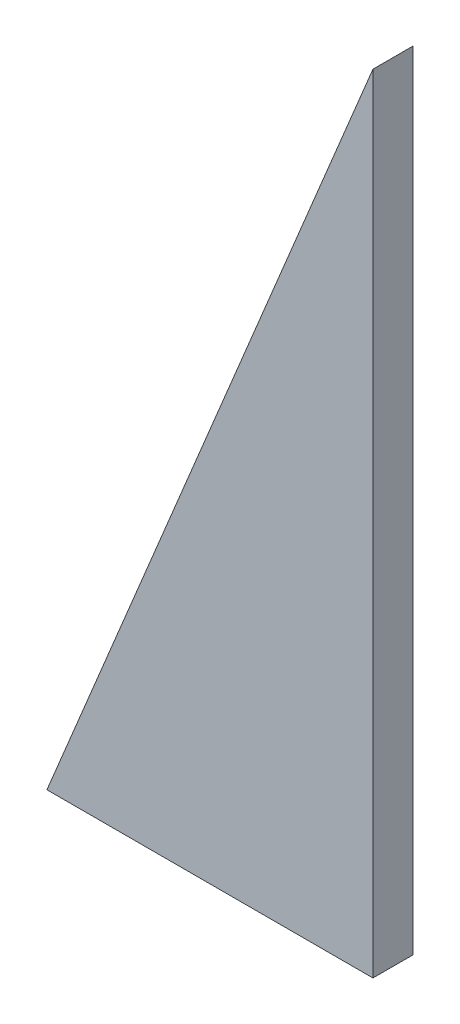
ISO-10303-21;
HEADER;
FILE_DESCRIPTION(('STEP AP214'),'2;1');
FILE_NAME('part.step','',(''),(''),'','','');
FILE_SCHEMA(('AUTOMOTIVE_DESIGN { 1 0 10303 214 1 1 1 1 }'));
ENDSEC;
DATA;
#1=APPLICATION_CONTEXT('core data for automotive mechanical design processes');
#2=APPLICATION_PROTOCOL_DEFINITION('international standard','automotive_design',2000,#1);
#3=PRODUCT_CONTEXT('',#1,'mechanical');
#4=PRODUCT('Part','Part','',(#3));
#5=PRODUCT_RELATED_PRODUCT_CATEGORY('part','',(#4));
#6=PRODUCT_DEFINITION_FORMATION('','',#4);
#7=PRODUCT_DEFINITION_CONTEXT('part definition',#1,'design');
#8=PRODUCT_DEFINITION('design','',#6,#7);
#9=PRODUCT_DEFINITION_SHAPE('','',#8);
#10=(LENGTH_UNIT() NAMED_UNIT(*) SI_UNIT(.MILLI.,.METRE.));
#11=(NAMED_UNIT(*) PLANE_ANGLE_UNIT() SI_UNIT($,.RADIAN.));
#12=(NAMED_UNIT(*) SI_UNIT($,.STERADIAN.) SOLID_ANGLE_UNIT());
#13=UNCERTAINTY_MEASURE_WITH_UNIT(LENGTH_MEASURE(1.E-05),#10,'distance_accuracy_value','');
#14=(GEOMETRIC_REPRESENTATION_CONTEXT(3) GLOBAL_UNCERTAINTY_ASSIGNED_CONTEXT((#13)) GLOBAL_UNIT_ASSIGNED_CONTEXT((#10,
#11,#12)) REPRESENTATION_CONTEXT('',''));
#15=CARTESIAN_POINT('',(0.,0.,0.));
#16=DIRECTION('',(0.,0.,1.));
#17=DIRECTION('',(1.,0.,0.));
#18=AXIS2_PLACEMENT_3D('',#15,#16,#17);
#19=CARTESIAN_POINT('',(65.,156.923881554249,8.));
#20=DIRECTION('',(0.923879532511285,-0.382683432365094,0.));
#21=DIRECTION('',(0.382683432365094,0.923879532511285,0.));
#22=AXIS2_PLACEMENT_3D('',#19,#20,#21);
#23=PLANE('',#22);
#24=CARTESIAN_POINT('',(13.3939201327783,32.335783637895,4.));
#25=DIRECTION('',(-0.923879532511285,0.382683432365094,0.));
#26=DIRECTION('',(-0.382683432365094,-0.923879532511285,0.));
#27=AXIS2_PLACEMENT_3D('',#24,#25,#26);
#28=CIRCLE('',#27,2.1);
#29=CARTESIAN_POINT('',(12.5902849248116,30.3956366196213,4.));
#30=VERTEX_POINT('',#29);
#31=EDGE_CURVE('E111',#30,#30,#28,.T.);
#32=ORIENTED_EDGE('',*,*,#31,.F.);
#33=EDGE_LOOP('',(#32));
#34=FACE_BOUND('',#33,.T.);
#35=CARTESIAN_POINT('',(42.0951775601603,101.626748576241,4.));
#36=DIRECTION('',(-0.923879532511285,0.382683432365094,0.));
#37=DIRECTION('',(-0.382683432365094,-0.923879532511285,0.));
#38=AXIS2_PLACEMENT_3D('',#35,#36,#37);
#39=CIRCLE('',#38,2.1);
#40=CARTESIAN_POINT('',(41.2915423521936,99.6866015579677,4.));
#41=VERTEX_POINT('',#40);
#42=EDGE_CURVE('E117',#41,#41,#39,.T.);
#43=ORIENTED_EDGE('',*,*,#42,.F.);
#44=EDGE_LOOP('',(#43));
#45=FACE_BOUND('',#44,.T.);
#46=DIRECTION('',(-0.382683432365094,-0.923879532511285,0.));
#47=VECTOR('',#46,1.);
#48=CARTESIAN_POINT('',(65.,156.923881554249,0.));
#49=LINE('',#48,#47);
#50=CARTESIAN_POINT('',(65.,156.923881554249,0.));
#51=VERTEX_POINT('',#50);
#52=CARTESIAN_POINT('',(0.,0.,0.));
#53=VERTEX_POINT('',#52);
#54=EDGE_CURVE('E123',#51,#53,#49,.T.);
#55=ORIENTED_EDGE('',*,*,#54,.T.);
#56=DIRECTION('',(0.,0.,-1.));
#57=VECTOR('',#56,1.);
#58=CARTESIAN_POINT('',(0.,0.,8.));
#59=LINE('',#58,#57);
#60=CARTESIAN_POINT('',(0.,0.,8.));
#61=VERTEX_POINT('',#60);
#62=EDGE_CURVE('E11',#61,#53,#59,.T.);
#63=ORIENTED_EDGE('',*,*,#62,.F.);
#64=DIRECTION('',(-0.382683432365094,-0.923879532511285,0.));
#65=VECTOR('',#64,1.);
#66=CARTESIAN_POINT('',(65.,156.923881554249,8.));
#67=LINE('',#66,#65);
#68=CARTESIAN_POINT('',(65.,156.923881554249,8.));
#69=VERTEX_POINT('',#68);
#70=EDGE_CURVE('E124',#69,#61,#67,.T.);
#71=ORIENTED_EDGE('',*,*,#70,.F.);
#72=DIRECTION('',(0.,0.,-1.));
#73=VECTOR('',#72,1.);
#74=CARTESIAN_POINT('',(65.,156.923881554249,8.));
#75=LINE('',#74,#73);
#76=EDGE_CURVE('E129',#69,#51,#75,.T.);
#77=ORIENTED_EDGE('',*,*,#76,.T.);
#78=EDGE_LOOP('',(#55,#63,#71,#77));
#79=FACE_BOUND('',#78,.T.);
#80=ADVANCED_FACE('F40',(#34,#45,#79),#23,.F.);
#81=CARTESIAN_POINT('',(0.,0.,8.));
#82=DIRECTION('',(0.,1.,0.));
#83=DIRECTION('',(0.,0.,1.));
#84=AXIS2_PLACEMENT_3D('',#81,#82,#83);
#85=PLANE('',#84);
#86=CARTESIAN_POINT('',(22.5,0.,4.));
#87=DIRECTION('',(0.,-1.,0.));
#88=DIRECTION('',(0.,0.,-1.));
#89=AXIS2_PLACEMENT_3D('',#86,#87,#88);
#90=CIRCLE('',#89,2.09999999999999);
#91=CARTESIAN_POINT('',(22.5,0.,1.90000000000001));
#92=VERTEX_POINT('',#91);
#93=EDGE_CURVE('E101',#92,#92,#90,.T.);
#94=ORIENTED_EDGE('',*,*,#93,.F.);
#95=EDGE_LOOP('',(#94));
#96=FACE_BOUND('',#95,.T.);
#97=CARTESIAN_POINT('',(52.5,0.,4.00000000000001));
#98=DIRECTION('',(0.,-1.,0.));
#99=DIRECTION('',(0.,0.,-1.));
#100=AXIS2_PLACEMENT_3D('',#97,#98,#99);
#101=CIRCLE('',#100,2.09999999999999);
#102=CARTESIAN_POINT('',(52.5,0.,1.90000000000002));
#103=VERTEX_POINT('',#102);
#104=EDGE_CURVE('E100',#103,#103,#101,.T.);
#105=ORIENTED_EDGE('',*,*,#104,.F.);
#106=EDGE_LOOP('',(#105));
#107=FACE_BOUND('',#106,.T.);
#108=DIRECTION('',(1.,0.,0.));
#109=VECTOR('',#108,1.);
#110=CARTESIAN_POINT('',(0.,0.,0.));
#111=LINE('',#110,#109);
#112=CARTESIAN_POINT('',(65.,0.,0.));
#113=VERTEX_POINT('',#112);
#114=EDGE_CURVE('E69',#53,#113,#111,.T.);
#115=ORIENTED_EDGE('',*,*,#114,.T.);
#116=DIRECTION('',(0.,0.,-1.));
#117=VECTOR('',#116,1.);
#118=CARTESIAN_POINT('',(65.,0.,8.));
#119=LINE('',#118,#117);
#120=CARTESIAN_POINT('',(65.,0.,8.));
#121=VERTEX_POINT('',#120);
#122=EDGE_CURVE('E48',#121,#113,#119,.T.);
#123=ORIENTED_EDGE('',*,*,#122,.F.);
#124=DIRECTION('',(1.,0.,0.));
#125=VECTOR('',#124,1.);
#126=CARTESIAN_POINT('',(0.,0.,8.));
#127=LINE('',#126,#125);
#128=EDGE_CURVE('E77',#61,#121,#127,.T.);
#129=ORIENTED_EDGE('',*,*,#128,.F.);
#130=ORIENTED_EDGE('',*,*,#62,.T.);
#131=EDGE_LOOP('',(#115,#123,#129,#130));
#132=FACE_BOUND('',#131,.T.);
#133=ADVANCED_FACE('F150',(#96,#107,#132),#85,.F.);
#134=CARTESIAN_POINT('',(65.,0.,8.));
#135=DIRECTION('',(-1.,0.,0.));
#136=DIRECTION('',(0.,0.,1.));
#137=AXIS2_PLACEMENT_3D('',#134,#135,#136);
#138=PLANE('',#137);
#139=DIRECTION('',(0.,1.,0.));
#140=VECTOR('',#139,1.);
#141=CARTESIAN_POINT('',(65.,0.,0.));
#142=LINE('',#141,#140);
#143=EDGE_CURVE('E74',#113,#51,#142,.T.);
#144=ORIENTED_EDGE('',*,*,#143,.T.);
#145=ORIENTED_EDGE('',*,*,#76,.F.);
#146=DIRECTION('',(0.,1.,0.));
#147=VECTOR('',#146,1.);
#148=CARTESIAN_POINT('',(65.,0.,8.));
#149=LINE('',#148,#147);
#150=EDGE_CURVE('E56',#121,#69,#149,.T.);
#151=ORIENTED_EDGE('',*,*,#150,.F.);
#152=ORIENTED_EDGE('',*,*,#122,.T.);
#153=EDGE_LOOP('',(#144,#145,#151,#152));
#154=FACE_BOUND('',#153,.T.);
#155=ADVANCED_FACE('F134',(#154),#138,.F.);
#156=CARTESIAN_POINT('',(0.,0.,8.));
#157=DIRECTION('',(0.,0.,1.));
#158=DIRECTION('',(1.,0.,0.));
#159=AXIS2_PLACEMENT_3D('',#156,#157,#158);
#160=PLANE('',#159);
#161=ORIENTED_EDGE('',*,*,#70,.T.);
#162=ORIENTED_EDGE('',*,*,#128,.T.);
#163=ORIENTED_EDGE('',*,*,#150,.T.);
#164=EDGE_LOOP('',(#161,#162,#163));
#165=FACE_BOUND('',#164,.T.);
#166=ADVANCED_FACE('F141',(#165),#160,.T.);
#167=CARTESIAN_POINT('',(0.,0.,0.));
#168=DIRECTION('',(0.,0.,1.));
#169=DIRECTION('',(1.,0.,0.));
#170=AXIS2_PLACEMENT_3D('',#167,#168,#169);
#171=PLANE('',#170);
#172=ORIENTED_EDGE('',*,*,#54,.F.);
#173=ORIENTED_EDGE('',*,*,#143,.F.);
#174=ORIENTED_EDGE('',*,*,#114,.F.);
#175=EDGE_LOOP('',(#172,#173,#174));
#176=FACE_BOUND('',#175,.T.);
#177=ADVANCED_FACE('F137',(#176),#171,.F.);
#178=CARTESIAN_POINT('',(55.0294910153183,96.2691805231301,4.));
#179=DIRECTION('',(-0.923879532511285,0.382683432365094,0.));
#180=DIRECTION('',(-0.382683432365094,-0.923879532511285,0.));
#181=AXIS2_PLACEMENT_3D('',#178,#179,#180);
#182=CONICAL_SURFACE('',#181,2.1,1.02974425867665);
#183=CARTESIAN_POINT('',(56.1952489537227,95.7863077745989,4.));
#184=VERTEX_POINT('',#183);
#185=VERTEX_LOOP('',#184);
#186=FACE_BOUND('',#185,.T.);
#187=CARTESIAN_POINT('',(55.0294910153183,96.2691805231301,4.));
#188=DIRECTION('',(-0.923879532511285,0.382683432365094,0.));
#189=DIRECTION('',(-0.382683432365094,-0.923879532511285,0.));
#190=AXIS2_PLACEMENT_3D('',#187,#188,#189);
#191=CIRCLE('',#190,2.1);
#192=CARTESIAN_POINT('',(54.2258558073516,94.3290335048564,4.));
#193=VERTEX_POINT('',#192);
#194=EDGE_CURVE('E120',#193,#193,#191,.T.);
#195=ORIENTED_EDGE('',*,*,#194,.T.);
#196=EDGE_LOOP('',(#195));
#197=FACE_BOUND('',#196,.T.);
#198=ADVANCED_FACE('F148',(#186,#197),#182,.F.);
#199=CARTESIAN_POINT('',(42.0951775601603,101.626748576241,4.));
#200=DIRECTION('',(-0.923879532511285,0.382683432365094,0.));
#201=DIRECTION('',(-0.382683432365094,-0.923879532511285,0.));
#202=AXIS2_PLACEMENT_3D('',#199,#200,#201);
#203=CYLINDRICAL_SURFACE('',#202,2.1);
#204=ORIENTED_EDGE('',*,*,#194,.F.);
#205=EDGE_LOOP('',(#204));
#206=FACE_BOUND('',#205,.T.);
#207=ORIENTED_EDGE('',*,*,#42,.T.);
#208=EDGE_LOOP('',(#207));
#209=FACE_BOUND('',#208,.T.);
#210=ADVANCED_FACE('F163',(#206,#209),#203,.F.);
#211=CARTESIAN_POINT('',(26.3282335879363,26.9782155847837,4.));
#212=DIRECTION('',(-0.923879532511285,0.382683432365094,0.));
#213=DIRECTION('',(-0.382683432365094,-0.923879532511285,0.));
#214=AXIS2_PLACEMENT_3D('',#211,#212,#213);
#215=CONICAL_SURFACE('',#214,2.1,1.02974425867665);
#216=CARTESIAN_POINT('',(27.4939915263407,26.4953428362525,4.));
#217=VERTEX_POINT('',#216);
#218=VERTEX_LOOP('',#217);
#219=FACE_BOUND('',#218,.T.);
#220=CARTESIAN_POINT('',(26.3282335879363,26.9782155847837,4.));
#221=DIRECTION('',(-0.923879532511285,0.382683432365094,0.));
#222=DIRECTION('',(-0.382683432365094,-0.923879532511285,0.));
#223=AXIS2_PLACEMENT_3D('',#220,#221,#222);
#224=CIRCLE('',#223,2.1);
#225=CARTESIAN_POINT('',(25.5245983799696,25.03806856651,4.));
#226=VERTEX_POINT('',#225);
#227=EDGE_CURVE('E114',#226,#226,#224,.T.);
#228=ORIENTED_EDGE('',*,*,#227,.T.);
#229=EDGE_LOOP('',(#228));
#230=FACE_BOUND('',#229,.T.);
#231=ADVANCED_FACE('F165',(#219,#230),#215,.F.);
#232=CARTESIAN_POINT('',(13.3939201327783,32.335783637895,4.));
#233=DIRECTION('',(-0.923879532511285,0.382683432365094,0.));
#234=DIRECTION('',(-0.382683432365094,-0.923879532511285,0.));
#235=AXIS2_PLACEMENT_3D('',#232,#233,#234);
#236=CYLINDRICAL_SURFACE('',#235,2.1);
#237=ORIENTED_EDGE('',*,*,#227,.F.);
#238=EDGE_LOOP('',(#237));
#239=FACE_BOUND('',#238,.T.);
#240=ORIENTED_EDGE('',*,*,#31,.T.);
#241=EDGE_LOOP('',(#240));
#242=FACE_BOUND('',#241,.T.);
#243=ADVANCED_FACE('F172',(#239,#242),#236,.F.);
#244=CARTESIAN_POINT('',(52.5,14.,4.00000000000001));
#245=DIRECTION('',(0.,-1.,0.));
#246=DIRECTION('',(0.,0.,-1.));
#247=AXIS2_PLACEMENT_3D('',#244,#245,#246);
#248=CONICAL_SURFACE('',#247,2.09999999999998,1.02974425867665);
#249=CARTESIAN_POINT('',(52.5,15.2618072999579,4.00000000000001));
#250=VERTEX_POINT('',#249);
#251=VERTEX_LOOP('',#250);
#252=FACE_BOUND('',#251,.T.);
#253=CARTESIAN_POINT('',(52.5,14.,4.00000000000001));
#254=DIRECTION('',(0.,-1.,0.));
#255=DIRECTION('',(0.,0.,-1.));
#256=AXIS2_PLACEMENT_3D('',#253,#254,#255);
#257=CIRCLE('',#256,2.09999999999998);
#258=CARTESIAN_POINT('',(52.5,14.,1.90000000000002));
#259=VERTEX_POINT('',#258);
#260=EDGE_CURVE('E104',#259,#259,#257,.T.);
#261=ORIENTED_EDGE('',*,*,#260,.T.);
#262=EDGE_LOOP('',(#261));
#263=FACE_BOUND('',#262,.T.);
#264=ADVANCED_FACE('F180',(#252,#263),#248,.F.);
#265=CARTESIAN_POINT('',(52.5,0.,4.00000000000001));
#266=DIRECTION('',(0.,-1.,0.));
#267=DIRECTION('',(0.,0.,-1.));
#268=AXIS2_PLACEMENT_3D('',#265,#266,#267);
#269=CYLINDRICAL_SURFACE('',#268,2.09999999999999);
#270=ORIENTED_EDGE('',*,*,#260,.F.);
#271=EDGE_LOOP('',(#270));
#272=FACE_BOUND('',#271,.T.);
#273=ORIENTED_EDGE('',*,*,#104,.T.);
#274=EDGE_LOOP('',(#273));
#275=FACE_BOUND('',#274,.T.);
#276=ADVANCED_FACE('F94',(#272,#275),#269,.F.);
#277=CARTESIAN_POINT('',(22.5,14.,4.));
#278=DIRECTION('',(0.,-1.,0.));
#279=DIRECTION('',(0.,0.,-1.));
#280=AXIS2_PLACEMENT_3D('',#277,#278,#279);
#281=CONICAL_SURFACE('',#280,2.09999999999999,1.02974425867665);
#282=CARTESIAN_POINT('',(22.5,15.2618072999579,4.));
#283=VERTEX_POINT('',#282);
#284=VERTEX_LOOP('',#283);
#285=FACE_BOUND('',#284,.T.);
#286=CARTESIAN_POINT('',(22.5,14.,4.));
#287=DIRECTION('',(0.,-1.,0.));
#288=DIRECTION('',(0.,0.,-1.));
#289=AXIS2_PLACEMENT_3D('',#286,#287,#288);
#290=CIRCLE('',#289,2.09999999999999);
#291=CARTESIAN_POINT('',(22.5,14.,1.90000000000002));
#292=VERTEX_POINT('',#291);
#293=EDGE_CURVE('E98',#292,#292,#290,.T.);
#294=ORIENTED_EDGE('',*,*,#293,.T.);
#295=EDGE_LOOP('',(#294));
#296=FACE_BOUND('',#295,.T.);
#297=ADVANCED_FACE('F90',(#285,#296),#281,.F.);
#298=CARTESIAN_POINT('',(22.5,0.,4.));
#299=DIRECTION('',(0.,-1.,0.));
#300=DIRECTION('',(0.,0.,-1.));
#301=AXIS2_PLACEMENT_3D('',#298,#299,#300);
#302=CYLINDRICAL_SURFACE('',#301,2.09999999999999);
#303=ORIENTED_EDGE('',*,*,#293,.F.);
#304=EDGE_LOOP('',(#303));
#305=FACE_BOUND('',#304,.T.);
#306=ORIENTED_EDGE('',*,*,#93,.T.);
#307=EDGE_LOOP('',(#306));
#308=FACE_BOUND('',#307,.T.);
#309=ADVANCED_FACE('F93',(#305,#308),#302,.F.);
#310=CLOSED_SHELL('',(#80,#133,#155,#166,#177,#198,#210,#231,#243,#264,#276,#297,#309));
#311=MANIFOLD_SOLID_BREP('B2',#310);
#312=ADVANCED_BREP_SHAPE_REPRESENTATION('',(#18,#311),#14);
#313=SHAPE_DEFINITION_REPRESENTATION(#9,#312);
ENDSEC;
END-ISO-10303-21;
